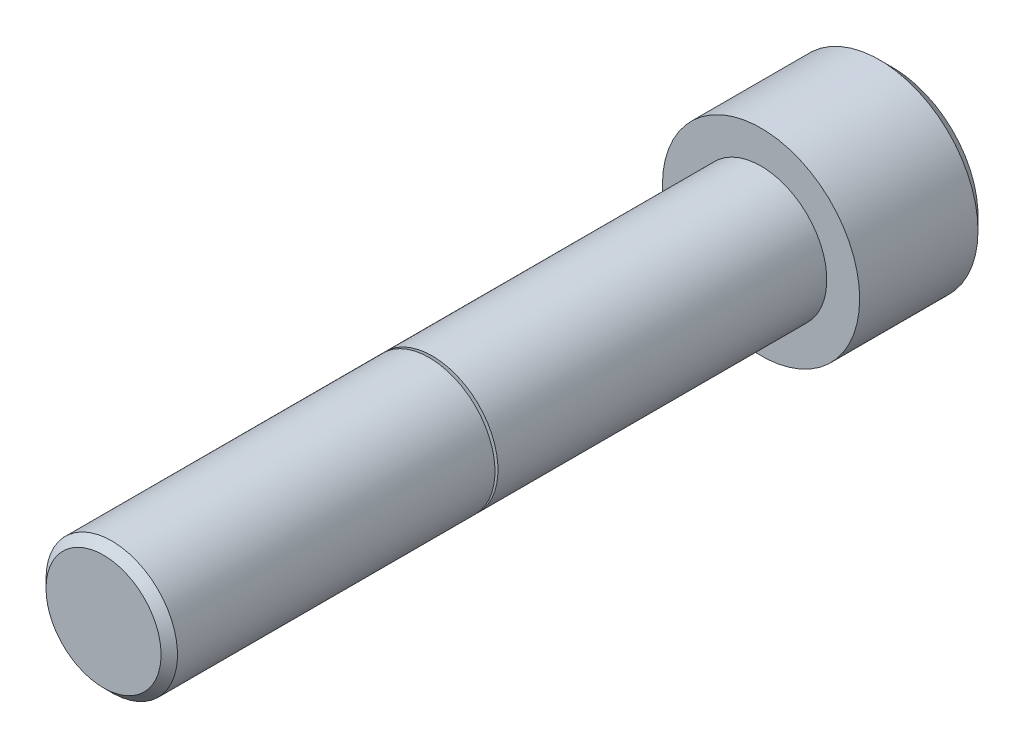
ISO-10303-21;
HEADER;
FILE_DESCRIPTION(('STEP AP214'),'2;1');
FILE_NAME('part.step','',(''),(''),'','','');
FILE_SCHEMA(('AUTOMOTIVE_DESIGN { 1 0 10303 214 1 1 1 1 }'));
ENDSEC;
DATA;
#1=APPLICATION_CONTEXT('core data for automotive mechanical design processes');
#2=APPLICATION_PROTOCOL_DEFINITION('international standard','automotive_design',2000,#1);
#3=PRODUCT_CONTEXT('',#1,'mechanical');
#4=PRODUCT('Part','Part','',(#3));
#5=PRODUCT_RELATED_PRODUCT_CATEGORY('part','',(#4));
#6=PRODUCT_DEFINITION_FORMATION('','',#4);
#7=PRODUCT_DEFINITION_CONTEXT('part definition',#1,'design');
#8=PRODUCT_DEFINITION('design','',#6,#7);
#9=PRODUCT_DEFINITION_SHAPE('','',#8);
#10=(LENGTH_UNIT() NAMED_UNIT(*) SI_UNIT(.MILLI.,.METRE.));
#11=(NAMED_UNIT(*) PLANE_ANGLE_UNIT() SI_UNIT($,.RADIAN.));
#12=(NAMED_UNIT(*) SI_UNIT($,.STERADIAN.) SOLID_ANGLE_UNIT());
#13=UNCERTAINTY_MEASURE_WITH_UNIT(LENGTH_MEASURE(1.E-05),#10,'distance_accuracy_value','');
#14=(GEOMETRIC_REPRESENTATION_CONTEXT(3) GLOBAL_UNCERTAINTY_ASSIGNED_CONTEXT((#13)) GLOBAL_UNIT_ASSIGNED_CONTEXT((#10,
#11,#12)) REPRESENTATION_CONTEXT('',''));
#15=CARTESIAN_POINT('',(0.,0.,0.));
#16=DIRECTION('',(0.,0.,1.));
#17=DIRECTION('',(1.,0.,0.));
#18=AXIS2_PLACEMENT_3D('',#15,#16,#17);
#19=CARTESIAN_POINT('',(0.,0.,-25.4));
#20=DIRECTION('',(0.,0.,1.));
#21=DIRECTION('',(1.,0.,0.));
#22=AXIS2_PLACEMENT_3D('',#19,#20,#21);
#23=PLANE('',#22);
#24=DIRECTION('',(-0.5,-0.866025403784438,0.));
#25=VECTOR('',#24,1.);
#26=CARTESIAN_POINT('',(10.9985226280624,0.,-25.4));
#27=LINE('',#26,#25);
#28=CARTESIAN_POINT('',(10.9985226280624,0.,-25.4));
#29=VERTEX_POINT('',#28);
#30=CARTESIAN_POINT('',(5.49926131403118,-9.525,-25.4));
#31=VERTEX_POINT('',#30);
#32=EDGE_CURVE('E133',#29,#31,#27,.T.);
#33=ORIENTED_EDGE('',*,*,#32,.F.);
#34=DIRECTION('',(0.5,-0.866025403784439,0.));
#35=VECTOR('',#34,1.);
#36=CARTESIAN_POINT('',(5.49926131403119,9.525,-25.4));
#37=LINE('',#36,#35);
#38=CARTESIAN_POINT('',(5.49926131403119,9.525,-25.4));
#39=VERTEX_POINT('',#38);
#40=EDGE_CURVE('E59',#39,#29,#37,.T.);
#41=ORIENTED_EDGE('',*,*,#40,.F.);
#42=DIRECTION('',(1.,0.,0.));
#43=VECTOR('',#42,1.);
#44=CARTESIAN_POINT('',(-5.49926131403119,9.525,-25.4));
#45=LINE('',#44,#43);
#46=CARTESIAN_POINT('',(-5.49926131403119,9.525,-25.4));
#47=VERTEX_POINT('',#46);
#48=EDGE_CURVE('E142',#47,#39,#45,.T.);
#49=ORIENTED_EDGE('',*,*,#48,.F.);
#50=DIRECTION('',(0.5,0.866025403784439,0.));
#51=VECTOR('',#50,1.);
#52=CARTESIAN_POINT('',(-10.9985226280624,0.,-25.4));
#53=LINE('',#52,#51);
#54=CARTESIAN_POINT('',(-10.9985226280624,0.,-25.4));
#55=VERTEX_POINT('',#54);
#56=EDGE_CURVE('E140',#55,#47,#53,.T.);
#57=ORIENTED_EDGE('',*,*,#56,.F.);
#58=DIRECTION('',(-0.5,0.866025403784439,0.));
#59=VECTOR('',#58,1.);
#60=CARTESIAN_POINT('',(-5.49926131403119,-9.525,-25.4));
#61=LINE('',#60,#59);
#62=CARTESIAN_POINT('',(-5.49926131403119,-9.525,-25.4));
#63=VERTEX_POINT('',#62);
#64=EDGE_CURVE('E107',#63,#55,#61,.T.);
#65=ORIENTED_EDGE('',*,*,#64,.F.);
#66=DIRECTION('',(-1.,0.,0.));
#67=VECTOR('',#66,1.);
#68=CARTESIAN_POINT('',(5.49926131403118,-9.525,-25.4));
#69=LINE('',#68,#67);
#70=EDGE_CURVE('E136',#31,#63,#69,.T.);
#71=ORIENTED_EDGE('',*,*,#70,.F.);
#72=EDGE_LOOP('',(#33,#41,#49,#57,#65,#71));
#73=FACE_BOUND('',#72,.T.);
#74=CARTESIAN_POINT('',(0.,0.,-25.4));
#75=DIRECTION('',(0.,0.,-1.));
#76=DIRECTION('',(-1.,0.,0.));
#77=AXIS2_PLACEMENT_3D('',#74,#75,#76);
#78=CIRCLE('',#77,16.51);
#79=CARTESIAN_POINT('',(-16.51,0.,-25.4));
#80=VERTEX_POINT('',#79);
#81=EDGE_CURVE('E146',#80,#80,#78,.T.);
#82=ORIENTED_EDGE('',*,*,#81,.T.);
#83=EDGE_LOOP('',(#82));
#84=FACE_BOUND('',#83,.T.);
#85=ADVANCED_FACE('F45',(#73,#84),#23,.F.);
#86=CARTESIAN_POINT('',(-11.1125,0.,127.));
#87=DIRECTION('',(0.,0.,-1.));
#88=DIRECTION('',(-1.,0.,0.));
#89=AXIS2_PLACEMENT_3D('',#86,#87,#88);
#90=PLANE('',#89);
#91=CARTESIAN_POINT('',(0.,0.,127.));
#92=DIRECTION('',(0.,0.,-1.));
#93=DIRECTION('',(-1.,0.,0.));
#94=AXIS2_PLACEMENT_3D('',#91,#92,#93);
#95=CIRCLE('',#94,11.1125);
#96=CARTESIAN_POINT('',(-11.1125,0.,127.));
#97=VERTEX_POINT('',#96);
#98=EDGE_CURVE('E11',#97,#97,#95,.T.);
#99=ORIENTED_EDGE('',*,*,#98,.F.);
#100=EDGE_LOOP('',(#99));
#101=FACE_BOUND('',#100,.T.);
#102=ADVANCED_FACE('F182',(#101),#90,.F.);
#103=CARTESIAN_POINT('',(0.,0.,127.));
#104=DIRECTION('',(0.,0.,-1.));
#105=DIRECTION('',(-1.,0.,0.));
#106=AXIS2_PLACEMENT_3D('',#103,#104,#105);
#107=CONICAL_SURFACE('',#106,11.1125,0.785398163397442);
#108=CARTESIAN_POINT('',(0.,0.,125.4125));
#109=DIRECTION('',(0.,0.,-1.));
#110=DIRECTION('',(-1.,0.,0.));
#111=AXIS2_PLACEMENT_3D('',#108,#109,#110);
#112=CIRCLE('',#111,12.7);
#113=CARTESIAN_POINT('',(-12.7,0.,125.4125));
#114=VERTEX_POINT('',#113);
#115=EDGE_CURVE('E52',#114,#114,#112,.T.);
#116=ORIENTED_EDGE('',*,*,#115,.F.);
#117=EDGE_LOOP('',(#116));
#118=FACE_BOUND('',#117,.T.);
#119=ORIENTED_EDGE('',*,*,#98,.T.);
#120=EDGE_LOOP('',(#119));
#121=FACE_BOUND('',#120,.T.);
#122=ADVANCED_FACE('F179',(#118,#121),#107,.T.);
#123=CARTESIAN_POINT('',(0.,0.,-10.585154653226));
#124=DIRECTION('',(0.,0.,-1.));
#125=DIRECTION('',(-1.,0.,0.));
#126=AXIS2_PLACEMENT_3D('',#123,#124,#125);
#127=CYLINDRICAL_SURFACE('',#126,12.7);
#128=CARTESIAN_POINT('',(0.,0.,64.0878027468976));
#129=DIRECTION('',(0.,0.,-1.));
#130=DIRECTION('',(-1.,0.,0.));
#131=AXIS2_PLACEMENT_3D('',#128,#129,#130);
#132=CIRCLE('',#131,12.7);
#133=CARTESIAN_POINT('',(-12.7,0.,64.0878027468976));
#134=VERTEX_POINT('',#133);
#135=EDGE_CURVE('E172',#134,#134,#132,.T.);
#136=ORIENTED_EDGE('',*,*,#135,.F.);
#137=EDGE_LOOP('',(#136));
#138=FACE_BOUND('',#137,.T.);
#139=ORIENTED_EDGE('',*,*,#115,.T.);
#140=EDGE_LOOP('',(#139));
#141=FACE_BOUND('',#140,.T.);
#142=ADVANCED_FACE('F177',(#138,#141),#127,.T.);
#143=CARTESIAN_POINT('',(0.,0.,64.0878027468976));
#144=DIRECTION('',(0.,0.,1.));
#145=DIRECTION('',(1.,0.,0.));
#146=AXIS2_PLACEMENT_3D('',#143,#144,#145);
#147=CONICAL_SURFACE('',#146,12.7,1.22173047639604);
#148=CARTESIAN_POINT('',(0.,0.,63.5487938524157));
#149=DIRECTION('',(0.,0.,-1.));
#150=DIRECTION('',(-1.,0.,0.));
#151=AXIS2_PLACEMENT_3D('',#148,#149,#150);
#152=CIRCLE('',#151,11.2190852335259);
#153=CARTESIAN_POINT('',(-11.2190852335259,0.,63.5487938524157));
#154=VERTEX_POINT('',#153);
#155=EDGE_CURVE('E169',#154,#154,#152,.T.);
#156=ORIENTED_EDGE('',*,*,#155,.F.);
#157=EDGE_LOOP('',(#156));
#158=FACE_BOUND('',#157,.T.);
#159=ORIENTED_EDGE('',*,*,#135,.T.);
#160=EDGE_LOOP('',(#159));
#161=FACE_BOUND('',#160,.T.);
#162=ADVANCED_FACE('F194',(#158,#161),#147,.T.);
#163=CARTESIAN_POINT('',(0.,0.,63.53));
#164=DIRECTION('',(0.,0.,-1.));
#165=DIRECTION('',(-1.,0.,0.));
#166=AXIS2_PLACEMENT_3D('',#163,#164,#165);
#167=TOROIDAL_SURFACE('',#166,11.2259256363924,0.0200000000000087);
#168=CARTESIAN_POINT('',(0.,0.,63.51));
#169=DIRECTION('',(0.,0.,-1.));
#170=DIRECTION('',(-1.,0.,0.));
#171=AXIS2_PLACEMENT_3D('',#168,#169,#170);
#172=CIRCLE('',#171,11.2259256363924);
#173=CARTESIAN_POINT('',(-11.2259256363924,0.,63.51));
#174=VERTEX_POINT('',#173);
#175=EDGE_CURVE('E166',#174,#174,#172,.T.);
#176=ORIENTED_EDGE('',*,*,#175,.F.);
#177=EDGE_LOOP('',(#176));
#178=FACE_BOUND('',#177,.T.);
#179=ORIENTED_EDGE('',*,*,#155,.T.);
#180=EDGE_LOOP('',(#179));
#181=FACE_BOUND('',#180,.T.);
#182=ADVANCED_FACE('F198',(#178,#181),#167,.F.);
#183=CARTESIAN_POINT('',(-12.7,0.,63.51));
#184=DIRECTION('',(0.,0.,-1.));
#185=DIRECTION('',(-1.,0.,0.));
#186=AXIS2_PLACEMENT_3D('',#183,#184,#185);
#187=PLANE('',#186);
#188=CARTESIAN_POINT('',(0.,0.,63.51));
#189=DIRECTION('',(0.,0.,-1.));
#190=DIRECTION('',(-1.,0.,0.));
#191=AXIS2_PLACEMENT_3D('',#188,#189,#190);
#192=CIRCLE('',#191,12.7);
#193=CARTESIAN_POINT('',(-12.7,0.,63.51));
#194=VERTEX_POINT('',#193);
#195=EDGE_CURVE('E163',#194,#194,#192,.T.);
#196=ORIENTED_EDGE('',*,*,#195,.F.);
#197=EDGE_LOOP('',(#196));
#198=FACE_BOUND('',#197,.T.);
#199=ORIENTED_EDGE('',*,*,#175,.T.);
#200=EDGE_LOOP('',(#199));
#201=FACE_BOUND('',#200,.T.);
#202=ADVANCED_FACE('F202',(#198,#201),#187,.F.);
#203=CARTESIAN_POINT('',(0.,0.,-10.585154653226));
#204=DIRECTION('',(0.,0.,-1.));
#205=DIRECTION('',(-1.,0.,0.));
#206=AXIS2_PLACEMENT_3D('',#203,#204,#205);
#207=CYLINDRICAL_SURFACE('',#206,12.7);
#208=CARTESIAN_POINT('',(0.,0.,0.));
#209=DIRECTION('',(0.,0.,-1.));
#210=DIRECTION('',(-1.,0.,0.));
#211=AXIS2_PLACEMENT_3D('',#208,#209,#210);
#212=CIRCLE('',#211,12.7);
#213=CARTESIAN_POINT('',(-12.7,0.,0.));
#214=VERTEX_POINT('',#213);
#215=EDGE_CURVE('E160',#214,#214,#212,.T.);
#216=ORIENTED_EDGE('',*,*,#215,.F.);
#217=EDGE_LOOP('',(#216));
#218=FACE_BOUND('',#217,.T.);
#219=ORIENTED_EDGE('',*,*,#195,.T.);
#220=EDGE_LOOP('',(#219));
#221=FACE_BOUND('',#220,.T.);
#222=ADVANCED_FACE('F206',(#218,#221),#207,.T.);
#223=CARTESIAN_POINT('',(-19.05,0.,0.));
#224=DIRECTION('',(0.,0.,-1.));
#225=DIRECTION('',(-1.,0.,0.));
#226=AXIS2_PLACEMENT_3D('',#223,#224,#225);
#227=PLANE('',#226);
#228=CARTESIAN_POINT('',(0.,0.,0.));
#229=DIRECTION('',(0.,0.,-1.));
#230=DIRECTION('',(-1.,0.,0.));
#231=AXIS2_PLACEMENT_3D('',#228,#229,#230);
#232=CIRCLE('',#231,19.05);
#233=CARTESIAN_POINT('',(-19.05,0.,0.));
#234=VERTEX_POINT('',#233);
#235=EDGE_CURVE('E157',#234,#234,#232,.T.);
#236=ORIENTED_EDGE('',*,*,#235,.F.);
#237=EDGE_LOOP('',(#236));
#238=FACE_BOUND('',#237,.T.);
#239=ORIENTED_EDGE('',*,*,#215,.T.);
#240=EDGE_LOOP('',(#239));
#241=FACE_BOUND('',#240,.T.);
#242=ADVANCED_FACE('F210',(#238,#241),#227,.F.);
#243=CARTESIAN_POINT('',(0.,0.,-10.585154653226));
#244=DIRECTION('',(0.,0.,-1.));
#245=DIRECTION('',(-1.,0.,0.));
#246=AXIS2_PLACEMENT_3D('',#243,#244,#245);
#247=CYLINDRICAL_SURFACE('',#246,19.05);
#248=CARTESIAN_POINT('',(0.,0.,-22.86));
#249=DIRECTION('',(0.,0.,-1.));
#250=DIRECTION('',(-1.,0.,0.));
#251=AXIS2_PLACEMENT_3D('',#248,#249,#250);
#252=CIRCLE('',#251,19.05);
#253=CARTESIAN_POINT('',(-19.05,0.,-22.86));
#254=VERTEX_POINT('',#253);
#255=EDGE_CURVE('E154',#254,#254,#252,.T.);
#256=ORIENTED_EDGE('',*,*,#255,.F.);
#257=EDGE_LOOP('',(#256));
#258=FACE_BOUND('',#257,.T.);
#259=ORIENTED_EDGE('',*,*,#235,.T.);
#260=EDGE_LOOP('',(#259));
#261=FACE_BOUND('',#260,.T.);
#262=ADVANCED_FACE('F214',(#258,#261),#247,.T.);
#263=CARTESIAN_POINT('',(0.,0.,-22.86));
#264=DIRECTION('',(0.,0.,1.));
#265=DIRECTION('',(1.,0.,0.));
#266=AXIS2_PLACEMENT_3D('',#263,#264,#265);
#267=CONICAL_SURFACE('',#266,19.05,0.785398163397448);
#268=ORIENTED_EDGE('',*,*,#81,.F.);
#269=EDGE_LOOP('',(#268));
#270=FACE_BOUND('',#269,.T.);
#271=ORIENTED_EDGE('',*,*,#255,.T.);
#272=EDGE_LOOP('',(#271));
#273=FACE_BOUND('',#272,.T.);
#274=ADVANCED_FACE('F218',(#270,#273),#267,.T.);
#275=CARTESIAN_POINT('',(5.49926131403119,9.525,-12.7));
#276=DIRECTION('',(0.866025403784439,0.5,0.));
#277=DIRECTION('',(-0.5,0.866025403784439,0.));
#278=AXIS2_PLACEMENT_3D('',#275,#276,#277);
#279=PLANE('',#278);
#280=ORIENTED_EDGE('',*,*,#40,.T.);
#281=DIRECTION('',(0.,0.,-1.));
#282=VECTOR('',#281,1.);
#283=CARTESIAN_POINT('',(10.9985226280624,0.,-12.7));
#284=LINE('',#283,#282);
#285=CARTESIAN_POINT('',(10.9985226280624,0.,-12.7));
#286=VERTEX_POINT('',#285);
#287=EDGE_CURVE('E89',#286,#29,#284,.T.);
#288=ORIENTED_EDGE('',*,*,#287,.F.);
#289=DIRECTION('',(0.5,-0.866025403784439,0.));
#290=VECTOR('',#289,1.);
#291=CARTESIAN_POINT('',(5.49926131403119,9.525,-12.7));
#292=LINE('',#291,#290);
#293=CARTESIAN_POINT('',(5.49926131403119,9.525,-12.7));
#294=VERTEX_POINT('',#293);
#295=EDGE_CURVE('E144',#294,#286,#292,.T.);
#296=ORIENTED_EDGE('',*,*,#295,.F.);
#297=DIRECTION('',(0.,0.,-1.));
#298=VECTOR('',#297,1.);
#299=CARTESIAN_POINT('',(5.49926131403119,9.525,-12.7));
#300=LINE('',#299,#298);
#301=EDGE_CURVE('E67',#294,#39,#300,.T.);
#302=ORIENTED_EDGE('',*,*,#301,.T.);
#303=EDGE_LOOP('',(#280,#288,#296,#302));
#304=FACE_BOUND('',#303,.T.);
#305=ADVANCED_FACE('F222',(#304),#279,.F.);
#306=CARTESIAN_POINT('',(-5.49926131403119,9.525,-12.7));
#307=DIRECTION('',(0.,1.,0.));
#308=DIRECTION('',(0.,0.,1.));
#309=AXIS2_PLACEMENT_3D('',#306,#307,#308);
#310=PLANE('',#309);
#311=ORIENTED_EDGE('',*,*,#48,.T.);
#312=ORIENTED_EDGE('',*,*,#301,.F.);
#313=DIRECTION('',(1.,0.,0.));
#314=VECTOR('',#313,1.);
#315=CARTESIAN_POINT('',(-5.49926131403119,9.525,-12.7));
#316=LINE('',#315,#314);
#317=CARTESIAN_POINT('',(-5.49926131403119,9.525,-12.7));
#318=VERTEX_POINT('',#317);
#319=EDGE_CURVE('E119',#318,#294,#316,.T.);
#320=ORIENTED_EDGE('',*,*,#319,.F.);
#321=DIRECTION('',(0.,0.,-1.));
#322=VECTOR('',#321,1.);
#323=CARTESIAN_POINT('',(-5.49926131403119,9.525,-12.7));
#324=LINE('',#323,#322);
#325=EDGE_CURVE('E111',#318,#47,#324,.T.);
#326=ORIENTED_EDGE('',*,*,#325,.T.);
#327=EDGE_LOOP('',(#311,#312,#320,#326));
#328=FACE_BOUND('',#327,.T.);
#329=ADVANCED_FACE('F226',(#328),#310,.F.);
#330=CARTESIAN_POINT('',(-10.9985226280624,0.,-12.7));
#331=DIRECTION('',(-0.866025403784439,0.5,0.));
#332=DIRECTION('',(-0.5,-0.866025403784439,0.));
#333=AXIS2_PLACEMENT_3D('',#330,#331,#332);
#334=PLANE('',#333);
#335=ORIENTED_EDGE('',*,*,#56,.T.);
#336=ORIENTED_EDGE('',*,*,#325,.F.);
#337=DIRECTION('',(0.5,0.866025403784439,0.));
#338=VECTOR('',#337,1.);
#339=CARTESIAN_POINT('',(-10.9985226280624,0.,-12.7));
#340=LINE('',#339,#338);
#341=CARTESIAN_POINT('',(-10.9985226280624,0.,-12.7));
#342=VERTEX_POINT('',#341);
#343=EDGE_CURVE('E115',#342,#318,#340,.T.);
#344=ORIENTED_EDGE('',*,*,#343,.F.);
#345=DIRECTION('',(0.,0.,-1.));
#346=VECTOR('',#345,1.);
#347=CARTESIAN_POINT('',(-10.9985226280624,0.,-12.7));
#348=LINE('',#347,#346);
#349=EDGE_CURVE('E100',#342,#55,#348,.T.);
#350=ORIENTED_EDGE('',*,*,#349,.T.);
#351=EDGE_LOOP('',(#335,#336,#344,#350));
#352=FACE_BOUND('',#351,.T.);
#353=ADVANCED_FACE('F116',(#352),#334,.F.);
#354=CARTESIAN_POINT('',(-5.49926131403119,-9.525,-12.7));
#355=DIRECTION('',(-0.866025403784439,-0.5,0.));
#356=DIRECTION('',(0.5,-0.866025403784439,0.));
#357=AXIS2_PLACEMENT_3D('',#354,#355,#356);
#358=PLANE('',#357);
#359=ORIENTED_EDGE('',*,*,#64,.T.);
#360=ORIENTED_EDGE('',*,*,#349,.F.);
#361=DIRECTION('',(-0.5,0.866025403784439,0.));
#362=VECTOR('',#361,1.);
#363=CARTESIAN_POINT('',(-5.49926131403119,-9.525,-12.7));
#364=LINE('',#363,#362);
#365=CARTESIAN_POINT('',(-5.49926131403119,-9.525,-12.7));
#366=VERTEX_POINT('',#365);
#367=EDGE_CURVE('E104',#366,#342,#364,.T.);
#368=ORIENTED_EDGE('',*,*,#367,.F.);
#369=DIRECTION('',(0.,0.,-1.));
#370=VECTOR('',#369,1.);
#371=CARTESIAN_POINT('',(-5.49926131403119,-9.525,-12.7));
#372=LINE('',#371,#370);
#373=EDGE_CURVE('E112',#366,#63,#372,.T.);
#374=ORIENTED_EDGE('',*,*,#373,.T.);
#375=EDGE_LOOP('',(#359,#360,#368,#374));
#376=FACE_BOUND('',#375,.T.);
#377=ADVANCED_FACE('F102',(#376),#358,.F.);
#378=CARTESIAN_POINT('',(5.49926131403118,-9.525,-12.7));
#379=DIRECTION('',(0.,-1.,0.));
#380=DIRECTION('',(0.,0.,-1.));
#381=AXIS2_PLACEMENT_3D('',#378,#379,#380);
#382=PLANE('',#381);
#383=ORIENTED_EDGE('',*,*,#70,.T.);
#384=ORIENTED_EDGE('',*,*,#373,.F.);
#385=DIRECTION('',(-1.,0.,0.));
#386=VECTOR('',#385,1.);
#387=CARTESIAN_POINT('',(5.49926131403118,-9.525,-12.7));
#388=LINE('',#387,#386);
#389=CARTESIAN_POINT('',(5.49926131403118,-9.525,-12.7));
#390=VERTEX_POINT('',#389);
#391=EDGE_CURVE('E125',#390,#366,#388,.T.);
#392=ORIENTED_EDGE('',*,*,#391,.F.);
#393=DIRECTION('',(0.,0.,-1.));
#394=VECTOR('',#393,1.);
#395=CARTESIAN_POINT('',(5.49926131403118,-9.525,-12.7));
#396=LINE('',#395,#394);
#397=EDGE_CURVE('E149',#390,#31,#396,.T.);
#398=ORIENTED_EDGE('',*,*,#397,.T.);
#399=EDGE_LOOP('',(#383,#384,#392,#398));
#400=FACE_BOUND('',#399,.T.);
#401=ADVANCED_FACE('F230',(#400),#382,.F.);
#402=CARTESIAN_POINT('',(10.9985226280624,0.,-12.7));
#403=DIRECTION('',(0.866025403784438,-0.5,0.));
#404=DIRECTION('',(0.5,0.866025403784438,0.));
#405=AXIS2_PLACEMENT_3D('',#402,#403,#404);
#406=PLANE('',#405);
#407=ORIENTED_EDGE('',*,*,#32,.T.);
#408=ORIENTED_EDGE('',*,*,#397,.F.);
#409=DIRECTION('',(-0.5,-0.866025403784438,0.));
#410=VECTOR('',#409,1.);
#411=CARTESIAN_POINT('',(10.9985226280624,0.,-12.7));
#412=LINE('',#411,#410);
#413=EDGE_CURVE('E127',#286,#390,#412,.T.);
#414=ORIENTED_EDGE('',*,*,#413,.F.);
#415=ORIENTED_EDGE('',*,*,#287,.T.);
#416=EDGE_LOOP('',(#407,#408,#414,#415));
#417=FACE_BOUND('',#416,.T.);
#418=ADVANCED_FACE('F227',(#417),#406,.F.);
#419=CARTESIAN_POINT('',(16.4977839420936,-9.525,-12.7));
#420=DIRECTION('',(0.,0.,-1.));
#421=DIRECTION('',(-1.,0.,0.));
#422=AXIS2_PLACEMENT_3D('',#419,#420,#421);
#423=PLANE('',#422);
#424=ORIENTED_EDGE('',*,*,#295,.T.);
#425=ORIENTED_EDGE('',*,*,#413,.T.);
#426=ORIENTED_EDGE('',*,*,#391,.T.);
#427=ORIENTED_EDGE('',*,*,#367,.T.);
#428=ORIENTED_EDGE('',*,*,#343,.T.);
#429=ORIENTED_EDGE('',*,*,#319,.T.);
#430=EDGE_LOOP('',(#424,#425,#426,#427,#428,#429));
#431=FACE_BOUND('',#430,.T.);
#432=ADVANCED_FACE('F122',(#431),#423,.T.);
#433=CLOSED_SHELL('',(#85,#102,#122,#142,#162,#182,#202,#222,#242,#262,#274,#305,#329,#353,#377,
#401,#418,#432));
#434=MANIFOLD_SOLID_BREP('B2',#433);
#435=ADVANCED_BREP_SHAPE_REPRESENTATION('',(#18,#434),#14);
#436=SHAPE_DEFINITION_REPRESENTATION(#9,#435);
ENDSEC;
END-ISO-10303-21;
